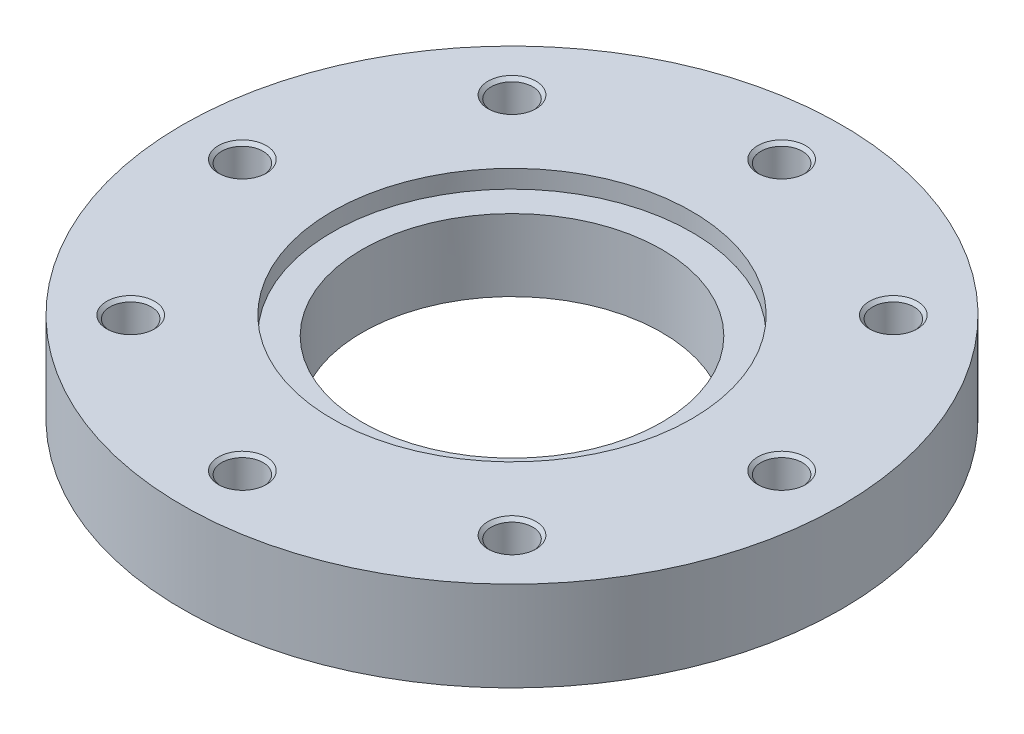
ISO-10303-21;
HEADER;
FILE_DESCRIPTION(('STEP AP214'),'2;1');
FILE_NAME('part.step','',(''),(''),'','','');
FILE_SCHEMA(('AUTOMOTIVE_DESIGN { 1 0 10303 214 1 1 1 1 }'));
ENDSEC;
DATA;
#1=APPLICATION_CONTEXT('core data for automotive mechanical design processes');
#2=APPLICATION_PROTOCOL_DEFINITION('international standard','automotive_design',2000,#1);
#3=PRODUCT_CONTEXT('',#1,'mechanical');
#4=PRODUCT('Part','Part','',(#3));
#5=PRODUCT_RELATED_PRODUCT_CATEGORY('part','',(#4));
#6=PRODUCT_DEFINITION_FORMATION('','',#4);
#7=PRODUCT_DEFINITION_CONTEXT('part definition',#1,'design');
#8=PRODUCT_DEFINITION('design','',#6,#7);
#9=PRODUCT_DEFINITION_SHAPE('','',#8);
#10=(LENGTH_UNIT() NAMED_UNIT(*) SI_UNIT(.MILLI.,.METRE.));
#11=(NAMED_UNIT(*) PLANE_ANGLE_UNIT() SI_UNIT($,.RADIAN.));
#12=(NAMED_UNIT(*) SI_UNIT($,.STERADIAN.) SOLID_ANGLE_UNIT());
#13=UNCERTAINTY_MEASURE_WITH_UNIT(LENGTH_MEASURE(1.E-05),#10,'distance_accuracy_value','');
#14=(GEOMETRIC_REPRESENTATION_CONTEXT(3) GLOBAL_UNCERTAINTY_ASSIGNED_CONTEXT((#13)) GLOBAL_UNIT_ASSIGNED_CONTEXT((#10,
#11,#12)) REPRESENTATION_CONTEXT('',''));
#15=CARTESIAN_POINT('',(0.,0.,0.));
#16=DIRECTION('',(0.,0.,1.));
#17=DIRECTION('',(1.,0.,0.));
#18=AXIS2_PLACEMENT_3D('',#15,#16,#17);
#19=CARTESIAN_POINT('',(0.,15.,0.));
#20=DIRECTION('',(0.,-1.,0.));
#21=DIRECTION('',(1.,0.,0.));
#22=AXIS2_PLACEMENT_3D('',#19,#20,#21);
#23=CYLINDRICAL_SURFACE('',#22,110.);
#24=CARTESIAN_POINT('',(0.,0.,0.));
#25=DIRECTION('',(0.,1.,0.));
#26=DIRECTION('',(1.,0.,0.));
#27=AXIS2_PLACEMENT_3D('',#24,#25,#26);
#28=CIRCLE('',#27,110.);
#29=CARTESIAN_POINT('',(110.,0.,0.));
#30=VERTEX_POINT('',#29);
#31=EDGE_CURVE('E9',#30,#30,#28,.T.);
#32=ORIENTED_EDGE('',*,*,#31,.T.);
#33=EDGE_LOOP('',(#32));
#34=FACE_BOUND('',#33,.T.);
#35=CARTESIAN_POINT('',(0.,30.,0.));
#36=DIRECTION('',(0.,1.,0.));
#37=DIRECTION('',(1.,0.,0.));
#38=AXIS2_PLACEMENT_3D('',#35,#36,#37);
#39=CIRCLE('',#38,110.);
#40=CARTESIAN_POINT('',(110.,30.,0.));
#41=VERTEX_POINT('',#40);
#42=EDGE_CURVE('E174',#41,#41,#39,.T.);
#43=ORIENTED_EDGE('',*,*,#42,.F.);
#44=EDGE_LOOP('',(#43));
#45=FACE_BOUND('',#44,.T.);
#46=ADVANCED_FACE('F15',(#34,#45),#23,.T.);
#47=CARTESIAN_POINT('',(80.,0.,0.));
#48=DIRECTION('',(0.,-1.,0.));
#49=DIRECTION('',(-1.,0.,0.));
#50=AXIS2_PLACEMENT_3D('',#47,#48,#49);
#51=PLANE('',#50);
#52=CARTESIAN_POINT('',(0.,0.,0.));
#53=DIRECTION('',(0.,1.,0.));
#54=DIRECTION('',(1.,0.,0.));
#55=AXIS2_PLACEMENT_3D('',#52,#53,#54);
#56=CIRCLE('',#55,50.);
#57=CARTESIAN_POINT('',(50.,0.,0.));
#58=VERTEX_POINT('',#57);
#59=EDGE_CURVE('E23',#58,#58,#56,.T.);
#60=ORIENTED_EDGE('',*,*,#59,.T.);
#61=EDGE_LOOP('',(#60));
#62=FACE_BOUND('',#61,.T.);
#63=ORIENTED_EDGE('',*,*,#31,.F.);
#64=EDGE_LOOP('',(#63));
#65=FACE_BOUND('',#64,.T.);
#66=ADVANCED_FACE('F312',(#62,#65),#51,.T.);
#67=CARTESIAN_POINT('',(0.,15.,0.));
#68=DIRECTION('',(0.,-1.,0.));
#69=DIRECTION('',(1.,0.,0.));
#70=AXIS2_PLACEMENT_3D('',#67,#68,#69);
#71=CYLINDRICAL_SURFACE('',#70,50.);
#72=ORIENTED_EDGE('',*,*,#59,.F.);
#73=EDGE_LOOP('',(#72));
#74=FACE_BOUND('',#73,.T.);
#75=CARTESIAN_POINT('',(0.,24.,0.));
#76=DIRECTION('',(0.,1.,0.));
#77=DIRECTION('',(1.,0.,0.));
#78=AXIS2_PLACEMENT_3D('',#75,#76,#77);
#79=CIRCLE('',#78,50.);
#80=CARTESIAN_POINT('',(-50.,24.,0.));
#81=VERTEX_POINT('',#80);
#82=EDGE_CURVE('E171',#81,#81,#79,.T.);
#83=ORIENTED_EDGE('',*,*,#82,.T.);
#84=EDGE_LOOP('',(#83));
#85=FACE_BOUND('',#84,.T.);
#86=ADVANCED_FACE('F172',(#74,#85),#71,.F.);
#87=CARTESIAN_POINT('',(80.,30.,0.));
#88=DIRECTION('',(0.,1.,0.));
#89=DIRECTION('',(1.,0.,0.));
#90=AXIS2_PLACEMENT_3D('',#87,#88,#89);
#91=PLANE('',#90);
#92=ORIENTED_EDGE('',*,*,#42,.T.);
#93=EDGE_LOOP('',(#92));
#94=FACE_BOUND('',#93,.T.);
#95=CARTESIAN_POINT('',(0.,30.,0.));
#96=DIRECTION('',(0.,-1.,0.));
#97=DIRECTION('',(1.,0.,0.));
#98=AXIS2_PLACEMENT_3D('',#95,#96,#97);
#99=CIRCLE('',#98,60.);
#100=CARTESIAN_POINT('',(-60.,30.,0.));
#101=VERTEX_POINT('',#100);
#102=EDGE_CURVE('E177',#101,#101,#99,.T.);
#103=ORIENTED_EDGE('',*,*,#102,.T.);
#104=EDGE_LOOP('',(#103));
#105=FACE_BOUND('',#104,.T.);
#106=CARTESIAN_POINT('',(90.,30.,0.));
#107=DIRECTION('',(0.,-1.,0.));
#108=DIRECTION('',(1.,0.,0.));
#109=AXIS2_PLACEMENT_3D('',#106,#107,#108);
#110=CIRCLE('',#109,8.);
#111=CARTESIAN_POINT('',(98.,30.,0.));
#112=VERTEX_POINT('',#111);
#113=EDGE_CURVE('E188',#112,#112,#110,.T.);
#114=ORIENTED_EDGE('',*,*,#113,.T.);
#115=EDGE_LOOP('',(#114));
#116=FACE_BOUND('',#115,.T.);
#117=CARTESIAN_POINT('',(63.6396103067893,30.,-63.6396103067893));
#118=DIRECTION('',(0.,-1.,0.));
#119=DIRECTION('',(0.707106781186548,0.,-0.707106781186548));
#120=AXIS2_PLACEMENT_3D('',#117,#118,#119);
#121=CIRCLE('',#120,8.);
#122=CARTESIAN_POINT('',(69.2964645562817,30.,-69.2964645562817));
#123=VERTEX_POINT('',#122);
#124=EDGE_CURVE('E199',#123,#123,#121,.T.);
#125=ORIENTED_EDGE('',*,*,#124,.T.);
#126=EDGE_LOOP('',(#125));
#127=FACE_BOUND('',#126,.T.);
#128=CARTESIAN_POINT('',(0.,30.,-90.));
#129=DIRECTION('',(0.,-1.,0.));
#130=DIRECTION('',(0.,0.,-1.));
#131=AXIS2_PLACEMENT_3D('',#128,#129,#130);
#132=CIRCLE('',#131,8.);
#133=CARTESIAN_POINT('',(0.,30.,-98.));
#134=VERTEX_POINT('',#133);
#135=EDGE_CURVE('E209',#134,#134,#132,.T.);
#136=ORIENTED_EDGE('',*,*,#135,.T.);
#137=EDGE_LOOP('',(#136));
#138=FACE_BOUND('',#137,.T.);
#139=CARTESIAN_POINT('',(-63.6396103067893,30.,-63.6396103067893));
#140=DIRECTION('',(0.,-1.,0.));
#141=DIRECTION('',(-0.707106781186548,0.,-0.707106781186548));
#142=AXIS2_PLACEMENT_3D('',#139,#140,#141);
#143=CIRCLE('',#142,8.);
#144=CARTESIAN_POINT('',(-69.2964645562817,30.,-69.2964645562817));
#145=VERTEX_POINT('',#144);
#146=EDGE_CURVE('E223',#145,#145,#143,.T.);
#147=ORIENTED_EDGE('',*,*,#146,.T.);
#148=EDGE_LOOP('',(#147));
#149=FACE_BOUND('',#148,.T.);
#150=CARTESIAN_POINT('',(-90.,30.,0.));
#151=DIRECTION('',(0.,-1.,0.));
#152=DIRECTION('',(-1.,0.,0.));
#153=AXIS2_PLACEMENT_3D('',#150,#151,#152);
#154=CIRCLE('',#153,8.);
#155=CARTESIAN_POINT('',(-98.,30.,0.));
#156=VERTEX_POINT('',#155);
#157=EDGE_CURVE('E235',#156,#156,#154,.T.);
#158=ORIENTED_EDGE('',*,*,#157,.T.);
#159=EDGE_LOOP('',(#158));
#160=FACE_BOUND('',#159,.T.);
#161=CARTESIAN_POINT('',(-63.6396103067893,30.,63.6396103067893));
#162=DIRECTION('',(0.,-1.,0.));
#163=DIRECTION('',(-0.707106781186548,0.,0.707106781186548));
#164=AXIS2_PLACEMENT_3D('',#161,#162,#163);
#165=CIRCLE('',#164,8.);
#166=CARTESIAN_POINT('',(-69.2964645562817,30.,69.2964645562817));
#167=VERTEX_POINT('',#166);
#168=EDGE_CURVE('E248',#167,#167,#165,.T.);
#169=ORIENTED_EDGE('',*,*,#168,.T.);
#170=EDGE_LOOP('',(#169));
#171=FACE_BOUND('',#170,.T.);
#172=CARTESIAN_POINT('',(0.,30.,90.));
#173=DIRECTION('',(0.,-1.,0.));
#174=DIRECTION('',(0.,0.,1.));
#175=AXIS2_PLACEMENT_3D('',#172,#173,#174);
#176=CIRCLE('',#175,8.);
#177=CARTESIAN_POINT('',(0.,30.,98.));
#178=VERTEX_POINT('',#177);
#179=EDGE_CURVE('E259',#178,#178,#176,.T.);
#180=ORIENTED_EDGE('',*,*,#179,.T.);
#181=EDGE_LOOP('',(#180));
#182=FACE_BOUND('',#181,.T.);
#183=CARTESIAN_POINT('',(63.6396103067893,30.,63.6396103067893));
#184=DIRECTION('',(0.,-1.,0.));
#185=DIRECTION('',(0.707106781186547,0.,0.707106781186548));
#186=AXIS2_PLACEMENT_3D('',#183,#184,#185);
#187=CIRCLE('',#186,8.);
#188=CARTESIAN_POINT('',(69.2964645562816,30.,69.2964645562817));
#189=VERTEX_POINT('',#188);
#190=EDGE_CURVE('E279',#189,#189,#187,.T.);
#191=ORIENTED_EDGE('',*,*,#190,.T.);
#192=EDGE_LOOP('',(#191));
#193=FACE_BOUND('',#192,.T.);
#194=ADVANCED_FACE('F382',(#94,#105,#116,#127,#138,#149,#160,#171,#182,#193),#91,.T.);
#195=CARTESIAN_POINT('',(0.,24.,0.));
#196=DIRECTION('',(0.,-1.,0.));
#197=DIRECTION('',(-1.,0.,0.));
#198=AXIS2_PLACEMENT_3D('',#195,#196,#197);
#199=PLANE('',#198);
#200=CARTESIAN_POINT('',(0.,24.,0.));
#201=DIRECTION('',(0.,-1.,0.));
#202=DIRECTION('',(1.,0.,0.));
#203=AXIS2_PLACEMENT_3D('',#200,#201,#202);
#204=CIRCLE('',#203,60.);
#205=CARTESIAN_POINT('',(60.,24.,0.));
#206=VERTEX_POINT('',#205);
#207=EDGE_CURVE('E175',#206,#206,#204,.T.);
#208=ORIENTED_EDGE('',*,*,#207,.F.);
#209=EDGE_LOOP('',(#208));
#210=FACE_BOUND('',#209,.T.);
#211=ORIENTED_EDGE('',*,*,#82,.F.);
#212=EDGE_LOOP('',(#211));
#213=FACE_BOUND('',#212,.T.);
#214=ADVANCED_FACE('F309',(#210,#213),#199,.F.);
#215=CARTESIAN_POINT('',(0.,28.5,0.));
#216=DIRECTION('',(0.,-1.,0.));
#217=DIRECTION('',(1.,0.,0.));
#218=AXIS2_PLACEMENT_3D('',#215,#216,#217);
#219=CYLINDRICAL_SURFACE('',#218,60.);
#220=ORIENTED_EDGE('',*,*,#207,.T.);
#221=EDGE_LOOP('',(#220));
#222=FACE_BOUND('',#221,.T.);
#223=ORIENTED_EDGE('',*,*,#102,.F.);
#224=EDGE_LOOP('',(#223));
#225=FACE_BOUND('',#224,.T.);
#226=ADVANCED_FACE('F17',(#222,#225),#219,.F.);
#227=CARTESIAN_POINT('',(90.,5.00308975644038,0.));
#228=DIRECTION('',(0.,1.,0.));
#229=DIRECTION('',(1.,0.,0.));
#230=AXIS2_PLACEMENT_3D('',#227,#228,#229);
#231=CONICAL_SURFACE('',#230,3.45875,1.0471975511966);
#232=CARTESIAN_POINT('',(90.,7.,0.));
#233=DIRECTION('',(0.,-1.,0.));
#234=DIRECTION('',(1.,0.,0.));
#235=AXIS2_PLACEMENT_3D('',#232,#233,#234);
#236=CIRCLE('',#235,6.9175);
#237=CARTESIAN_POINT('',(96.9175,7.,0.));
#238=VERTEX_POINT('',#237);
#239=EDGE_CURVE('E181',#238,#238,#236,.T.);
#240=ORIENTED_EDGE('',*,*,#239,.F.);
#241=EDGE_LOOP('',(#240));
#242=FACE_BOUND('',#241,.T.);
#243=CARTESIAN_POINT('',(90.,3.00617951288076,0.));
#244=VERTEX_POINT('',#243);
#245=VERTEX_LOOP('',#244);
#246=FACE_BOUND('',#245,.T.);
#247=ADVANCED_FACE('F299',(#242,#246),#231,.F.);
#248=CARTESIAN_POINT('',(90.,9.95875,0.));
#249=DIRECTION('',(0.,1.,0.));
#250=DIRECTION('',(1.,0.,0.));
#251=AXIS2_PLACEMENT_3D('',#248,#249,#250);
#252=CYLINDRICAL_SURFACE('',#251,6.9175);
#253=CARTESIAN_POINT('',(90.,12.9175,0.));
#254=DIRECTION('',(0.,-1.,0.));
#255=DIRECTION('',(1.,0.,0.));
#256=AXIS2_PLACEMENT_3D('',#253,#254,#255);
#257=CIRCLE('',#256,6.9175);
#258=CARTESIAN_POINT('',(96.9175,12.9175,0.));
#259=VERTEX_POINT('',#258);
#260=EDGE_CURVE('E183',#259,#259,#257,.T.);
#261=ORIENTED_EDGE('',*,*,#260,.F.);
#262=EDGE_LOOP('',(#261));
#263=FACE_BOUND('',#262,.T.);
#264=ORIENTED_EDGE('',*,*,#239,.T.);
#265=EDGE_LOOP('',(#264));
#266=FACE_BOUND('',#265,.T.);
#267=ADVANCED_FACE('F296',(#263,#266),#252,.F.);
#268=CARTESIAN_POINT('',(90.,13.45875,0.));
#269=DIRECTION('',(0.,1.,0.));
#270=DIRECTION('',(1.,0.,0.));
#271=AXIS2_PLACEMENT_3D('',#268,#269,#270);
#272=CONICAL_SURFACE('',#271,7.45875,0.785398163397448);
#273=CARTESIAN_POINT('',(90.,14.,0.));
#274=DIRECTION('',(0.,-1.,0.));
#275=DIRECTION('',(1.,0.,0.));
#276=AXIS2_PLACEMENT_3D('',#273,#274,#275);
#277=CIRCLE('',#276,8.);
#278=CARTESIAN_POINT('',(98.,14.,0.));
#279=VERTEX_POINT('',#278);
#280=EDGE_CURVE('E187',#279,#279,#277,.T.);
#281=ORIENTED_EDGE('',*,*,#280,.F.);
#282=EDGE_LOOP('',(#281));
#283=FACE_BOUND('',#282,.T.);
#284=ORIENTED_EDGE('',*,*,#260,.T.);
#285=EDGE_LOOP('',(#284));
#286=FACE_BOUND('',#285,.T.);
#287=ADVANCED_FACE('F294',(#283,#286),#272,.F.);
#288=CARTESIAN_POINT('',(97.45875,14.,0.));
#289=DIRECTION('',(0.,1.,0.));
#290=DIRECTION('',(-1.,0.,0.));
#291=AXIS2_PLACEMENT_3D('',#288,#289,#290);
#292=PLANE('',#291);
#293=CARTESIAN_POINT('',(90.,14.,0.));
#294=DIRECTION('',(0.,-1.,0.));
#295=DIRECTION('',(1.,0.,0.));
#296=AXIS2_PLACEMENT_3D('',#293,#294,#295);
#297=CIRCLE('',#296,6.9175);
#298=CARTESIAN_POINT('',(96.9175,14.,0.));
#299=VERTEX_POINT('',#298);
#300=EDGE_CURVE('E184',#299,#299,#297,.T.);
#301=ORIENTED_EDGE('',*,*,#300,.F.);
#302=EDGE_LOOP('',(#301));
#303=FACE_BOUND('',#302,.T.);
#304=ORIENTED_EDGE('',*,*,#280,.T.);
#305=EDGE_LOOP('',(#304));
#306=FACE_BOUND('',#305,.T.);
#307=ADVANCED_FACE('F426',(#303,#306),#292,.F.);
#308=CARTESIAN_POINT('',(90.,21.45875,0.));
#309=DIRECTION('',(0.,1.,0.));
#310=DIRECTION('',(1.,0.,0.));
#311=AXIS2_PLACEMENT_3D('',#308,#309,#310);
#312=CYLINDRICAL_SURFACE('',#311,6.9175);
#313=CARTESIAN_POINT('',(90.,28.9175,0.));
#314=DIRECTION('',(0.,-1.,0.));
#315=DIRECTION('',(1.,0.,0.));
#316=AXIS2_PLACEMENT_3D('',#313,#314,#315);
#317=CIRCLE('',#316,6.9175);
#318=CARTESIAN_POINT('',(96.9175,28.9175,0.));
#319=VERTEX_POINT('',#318);
#320=EDGE_CURVE('E190',#319,#319,#317,.T.);
#321=ORIENTED_EDGE('',*,*,#320,.F.);
#322=EDGE_LOOP('',(#321));
#323=FACE_BOUND('',#322,.T.);
#324=ORIENTED_EDGE('',*,*,#300,.T.);
#325=EDGE_LOOP('',(#324));
#326=FACE_BOUND('',#325,.T.);
#327=ADVANCED_FACE('F422',(#323,#326),#312,.F.);
#328=CARTESIAN_POINT('',(90.,29.45875,0.));
#329=DIRECTION('',(0.,1.,0.));
#330=DIRECTION('',(1.,0.,0.));
#331=AXIS2_PLACEMENT_3D('',#328,#329,#330);
#332=CONICAL_SURFACE('',#331,7.45875,0.785398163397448);
#333=ORIENTED_EDGE('',*,*,#113,.F.);
#334=EDGE_LOOP('',(#333));
#335=FACE_BOUND('',#334,.T.);
#336=ORIENTED_EDGE('',*,*,#320,.T.);
#337=EDGE_LOOP('',(#336));
#338=FACE_BOUND('',#337,.T.);
#339=ADVANCED_FACE('F418',(#335,#338),#332,.F.);
#340=CARTESIAN_POINT('',(63.6396103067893,5.00308975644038,-63.6396103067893));
#341=DIRECTION('',(0.,1.,0.));
#342=DIRECTION('',(0.707106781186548,0.,-0.707106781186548));
#343=AXIS2_PLACEMENT_3D('',#340,#341,#342);
#344=CONICAL_SURFACE('',#343,3.45875,1.0471975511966);
#345=CARTESIAN_POINT('',(63.6396103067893,7.,-63.6396103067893));
#346=DIRECTION('',(0.,-1.,0.));
#347=DIRECTION('',(0.707106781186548,0.,-0.707106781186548));
#348=AXIS2_PLACEMENT_3D('',#345,#346,#347);
#349=CIRCLE('',#348,6.9175);
#350=CARTESIAN_POINT('',(68.5310214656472,7.,-68.5310214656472));
#351=VERTEX_POINT('',#350);
#352=EDGE_CURVE('E191',#351,#351,#349,.T.);
#353=ORIENTED_EDGE('',*,*,#352,.F.);
#354=EDGE_LOOP('',(#353));
#355=FACE_BOUND('',#354,.T.);
#356=CARTESIAN_POINT('',(63.6396103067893,3.00617951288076,-63.6396103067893));
#357=VERTEX_POINT('',#356);
#358=VERTEX_LOOP('',#357);
#359=FACE_BOUND('',#358,.T.);
#360=ADVANCED_FACE('F414',(#355,#359),#344,.F.);
#361=CARTESIAN_POINT('',(63.6396103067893,9.95875,-63.6396103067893));
#362=DIRECTION('',(0.,1.,0.));
#363=DIRECTION('',(0.707106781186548,0.,-0.707106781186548));
#364=AXIS2_PLACEMENT_3D('',#361,#362,#363);
#365=CYLINDRICAL_SURFACE('',#364,6.9175);
#366=CARTESIAN_POINT('',(63.6396103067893,12.9175,-63.6396103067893));
#367=DIRECTION('',(0.,-1.,0.));
#368=DIRECTION('',(0.707106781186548,0.,-0.707106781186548));
#369=AXIS2_PLACEMENT_3D('',#366,#367,#368);
#370=CIRCLE('',#369,6.9175);
#371=CARTESIAN_POINT('',(68.5310214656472,12.9175,-68.5310214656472));
#372=VERTEX_POINT('',#371);
#373=EDGE_CURVE('E193',#372,#372,#370,.T.);
#374=ORIENTED_EDGE('',*,*,#373,.F.);
#375=EDGE_LOOP('',(#374));
#376=FACE_BOUND('',#375,.T.);
#377=ORIENTED_EDGE('',*,*,#352,.T.);
#378=EDGE_LOOP('',(#377));
#379=FACE_BOUND('',#378,.T.);
#380=ADVANCED_FACE('F410',(#376,#379),#365,.F.);
#381=CARTESIAN_POINT('',(63.6396103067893,13.45875,-63.6396103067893));
#382=DIRECTION('',(0.,1.,0.));
#383=DIRECTION('',(0.707106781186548,0.,-0.707106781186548));
#384=AXIS2_PLACEMENT_3D('',#381,#382,#383);
#385=CONICAL_SURFACE('',#384,7.45875,0.785398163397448);
#386=CARTESIAN_POINT('',(63.6396103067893,14.,-63.6396103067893));
#387=DIRECTION('',(0.,-1.,0.));
#388=DIRECTION('',(0.707106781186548,0.,-0.707106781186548));
#389=AXIS2_PLACEMENT_3D('',#386,#387,#388);
#390=CIRCLE('',#389,8.);
#391=CARTESIAN_POINT('',(69.2964645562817,14.,-69.2964645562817));
#392=VERTEX_POINT('',#391);
#393=EDGE_CURVE('E195',#392,#392,#390,.T.);
#394=ORIENTED_EDGE('',*,*,#393,.F.);
#395=EDGE_LOOP('',(#394));
#396=FACE_BOUND('',#395,.T.);
#397=ORIENTED_EDGE('',*,*,#373,.T.);
#398=EDGE_LOOP('',(#397));
#399=FACE_BOUND('',#398,.T.);
#400=ADVANCED_FACE('F406',(#396,#399),#385,.F.);
#401=CARTESIAN_POINT('',(68.9137430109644,14.,-68.9137430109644));
#402=DIRECTION('',(0.,1.,0.));
#403=DIRECTION('',(-0.707106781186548,0.,0.707106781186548));
#404=AXIS2_PLACEMENT_3D('',#401,#402,#403);
#405=PLANE('',#404);
#406=CARTESIAN_POINT('',(63.6396103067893,14.,-63.6396103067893));
#407=DIRECTION('',(0.,-1.,0.));
#408=DIRECTION('',(0.707106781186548,0.,-0.707106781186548));
#409=AXIS2_PLACEMENT_3D('',#406,#407,#408);
#410=CIRCLE('',#409,6.9175);
#411=CARTESIAN_POINT('',(68.5310214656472,14.,-68.5310214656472));
#412=VERTEX_POINT('',#411);
#413=EDGE_CURVE('E197',#412,#412,#410,.T.);
#414=ORIENTED_EDGE('',*,*,#413,.F.);
#415=EDGE_LOOP('',(#414));
#416=FACE_BOUND('',#415,.T.);
#417=ORIENTED_EDGE('',*,*,#393,.T.);
#418=EDGE_LOOP('',(#417));
#419=FACE_BOUND('',#418,.T.);
#420=ADVANCED_FACE('F402',(#416,#419),#405,.F.);
#421=CARTESIAN_POINT('',(63.6396103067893,21.45875,-63.6396103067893));
#422=DIRECTION('',(0.,1.,0.));
#423=DIRECTION('',(0.707106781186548,0.,-0.707106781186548));
#424=AXIS2_PLACEMENT_3D('',#421,#422,#423);
#425=CYLINDRICAL_SURFACE('',#424,6.9175);
#426=CARTESIAN_POINT('',(63.6396103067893,28.9175,-63.6396103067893));
#427=DIRECTION('',(0.,-1.,0.));
#428=DIRECTION('',(0.707106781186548,0.,-0.707106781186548));
#429=AXIS2_PLACEMENT_3D('',#426,#427,#428);
#430=CIRCLE('',#429,6.9175);
#431=CARTESIAN_POINT('',(68.5310214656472,28.9175,-68.5310214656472));
#432=VERTEX_POINT('',#431);
#433=EDGE_CURVE('E200',#432,#432,#430,.T.);
#434=ORIENTED_EDGE('',*,*,#433,.F.);
#435=EDGE_LOOP('',(#434));
#436=FACE_BOUND('',#435,.T.);
#437=ORIENTED_EDGE('',*,*,#413,.T.);
#438=EDGE_LOOP('',(#437));
#439=FACE_BOUND('',#438,.T.);
#440=ADVANCED_FACE('F398',(#436,#439),#425,.F.);
#441=CARTESIAN_POINT('',(63.6396103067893,29.45875,-63.6396103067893));
#442=DIRECTION('',(0.,1.,0.));
#443=DIRECTION('',(0.707106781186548,0.,-0.707106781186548));
#444=AXIS2_PLACEMENT_3D('',#441,#442,#443);
#445=CONICAL_SURFACE('',#444,7.45875,0.785398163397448);
#446=ORIENTED_EDGE('',*,*,#124,.F.);
#447=EDGE_LOOP('',(#446));
#448=FACE_BOUND('',#447,.T.);
#449=ORIENTED_EDGE('',*,*,#433,.T.);
#450=EDGE_LOOP('',(#449));
#451=FACE_BOUND('',#450,.T.);
#452=ADVANCED_FACE('F394',(#448,#451),#445,.F.);
#453=CARTESIAN_POINT('',(0.,5.00308975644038,-90.));
#454=DIRECTION('',(0.,1.,0.));
#455=DIRECTION('',(0.,0.,-1.));
#456=AXIS2_PLACEMENT_3D('',#453,#454,#455);
#457=CONICAL_SURFACE('',#456,3.45875,1.0471975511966);
#458=CARTESIAN_POINT('',(0.,7.,-90.));
#459=DIRECTION('',(0.,-1.,0.));
#460=DIRECTION('',(0.,0.,-1.));
#461=AXIS2_PLACEMENT_3D('',#458,#459,#460);
#462=CIRCLE('',#461,6.9175);
#463=CARTESIAN_POINT('',(0.,7.,-96.9175));
#464=VERTEX_POINT('',#463);
#465=EDGE_CURVE('E202',#464,#464,#462,.T.);
#466=ORIENTED_EDGE('',*,*,#465,.F.);
#467=EDGE_LOOP('',(#466));
#468=FACE_BOUND('',#467,.T.);
#469=CARTESIAN_POINT('',(0.,3.00617951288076,-90.));
#470=VERTEX_POINT('',#469);
#471=VERTEX_LOOP('',#470);
#472=FACE_BOUND('',#471,.T.);
#473=ADVANCED_FACE('F390',(#468,#472),#457,.F.);
#474=CARTESIAN_POINT('',(0.,9.95875,-90.));
#475=DIRECTION('',(0.,1.,0.));
#476=DIRECTION('',(0.,0.,-1.));
#477=AXIS2_PLACEMENT_3D('',#474,#475,#476);
#478=CYLINDRICAL_SURFACE('',#477,6.9175);
#479=CARTESIAN_POINT('',(0.,12.9175,-90.));
#480=DIRECTION('',(0.,-1.,0.));
#481=DIRECTION('',(0.,0.,-1.));
#482=AXIS2_PLACEMENT_3D('',#479,#480,#481);
#483=CIRCLE('',#482,6.9175);
#484=CARTESIAN_POINT('',(0.,12.9175,-96.9175));
#485=VERTEX_POINT('',#484);
#486=EDGE_CURVE('E204',#485,#485,#483,.T.);
#487=ORIENTED_EDGE('',*,*,#486,.F.);
#488=EDGE_LOOP('',(#487));
#489=FACE_BOUND('',#488,.T.);
#490=ORIENTED_EDGE('',*,*,#465,.T.);
#491=EDGE_LOOP('',(#490));
#492=FACE_BOUND('',#491,.T.);
#493=ADVANCED_FACE('F386',(#489,#492),#478,.F.);
#494=CARTESIAN_POINT('',(0.,13.45875,-90.));
#495=DIRECTION('',(0.,1.,0.));
#496=DIRECTION('',(0.,0.,-1.));
#497=AXIS2_PLACEMENT_3D('',#494,#495,#496);
#498=CONICAL_SURFACE('',#497,7.45875,0.785398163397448);
#499=CARTESIAN_POINT('',(0.,14.,-90.));
#500=DIRECTION('',(0.,-1.,0.));
#501=DIRECTION('',(0.,0.,-1.));
#502=AXIS2_PLACEMENT_3D('',#499,#500,#501);
#503=CIRCLE('',#502,8.);
#504=CARTESIAN_POINT('',(0.,14.,-98.));
#505=VERTEX_POINT('',#504);
#506=EDGE_CURVE('E205',#505,#505,#503,.T.);
#507=ORIENTED_EDGE('',*,*,#506,.F.);
#508=EDGE_LOOP('',(#507));
#509=FACE_BOUND('',#508,.T.);
#510=ORIENTED_EDGE('',*,*,#486,.T.);
#511=EDGE_LOOP('',(#510));
#512=FACE_BOUND('',#511,.T.);
#513=ADVANCED_FACE('F378',(#509,#512),#498,.F.);
#514=CARTESIAN_POINT('',(0.,14.,-97.45875));
#515=DIRECTION('',(0.,1.,0.));
#516=DIRECTION('',(0.,0.,1.));
#517=AXIS2_PLACEMENT_3D('',#514,#515,#516);
#518=PLANE('',#517);
#519=CARTESIAN_POINT('',(0.,14.,-90.));
#520=DIRECTION('',(0.,-1.,0.));
#521=DIRECTION('',(0.,0.,-1.));
#522=AXIS2_PLACEMENT_3D('',#519,#520,#521);
#523=CIRCLE('',#522,6.9175);
#524=CARTESIAN_POINT('',(0.,14.,-96.9175));
#525=VERTEX_POINT('',#524);
#526=EDGE_CURVE('E208',#525,#525,#523,.T.);
#527=ORIENTED_EDGE('',*,*,#526,.F.);
#528=EDGE_LOOP('',(#527));
#529=FACE_BOUND('',#528,.T.);
#530=ORIENTED_EDGE('',*,*,#506,.T.);
#531=EDGE_LOOP('',(#530));
#532=FACE_BOUND('',#531,.T.);
#533=ADVANCED_FACE('F374',(#529,#532),#518,.F.);
#534=CARTESIAN_POINT('',(0.,21.45875,-90.));
#535=DIRECTION('',(0.,1.,0.));
#536=DIRECTION('',(0.,0.,-1.));
#537=AXIS2_PLACEMENT_3D('',#534,#535,#536);
#538=CYLINDRICAL_SURFACE('',#537,6.9175);
#539=CARTESIAN_POINT('',(0.,28.9175,-90.));
#540=DIRECTION('',(0.,-1.,0.));
#541=DIRECTION('',(0.,0.,-1.));
#542=AXIS2_PLACEMENT_3D('',#539,#540,#541);
#543=CIRCLE('',#542,6.9175);
#544=CARTESIAN_POINT('',(0.,28.9175,-96.9175));
#545=VERTEX_POINT('',#544);
#546=EDGE_CURVE('E212',#545,#545,#543,.T.);
#547=ORIENTED_EDGE('',*,*,#546,.F.);
#548=EDGE_LOOP('',(#547));
#549=FACE_BOUND('',#548,.T.);
#550=ORIENTED_EDGE('',*,*,#526,.T.);
#551=EDGE_LOOP('',(#550));
#552=FACE_BOUND('',#551,.T.);
#553=ADVANCED_FACE('F370',(#549,#552),#538,.F.);
#554=CARTESIAN_POINT('',(0.,29.45875,-90.));
#555=DIRECTION('',(0.,1.,0.));
#556=DIRECTION('',(0.,0.,-1.));
#557=AXIS2_PLACEMENT_3D('',#554,#555,#556);
#558=CONICAL_SURFACE('',#557,7.45875,0.785398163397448);
#559=ORIENTED_EDGE('',*,*,#135,.F.);
#560=EDGE_LOOP('',(#559));
#561=FACE_BOUND('',#560,.T.);
#562=ORIENTED_EDGE('',*,*,#546,.T.);
#563=EDGE_LOOP('',(#562));
#564=FACE_BOUND('',#563,.T.);
#565=ADVANCED_FACE('F366',(#561,#564),#558,.F.);
#566=CARTESIAN_POINT('',(-63.6396103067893,5.00308975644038,-63.6396103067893));
#567=DIRECTION('',(0.,1.,0.));
#568=DIRECTION('',(-0.707106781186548,0.,-0.707106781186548));
#569=AXIS2_PLACEMENT_3D('',#566,#567,#568);
#570=CONICAL_SURFACE('',#569,3.45875,1.0471975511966);
#571=CARTESIAN_POINT('',(-63.6396103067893,7.,-63.6396103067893));
#572=DIRECTION('',(0.,-1.,0.));
#573=DIRECTION('',(-0.707106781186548,0.,-0.707106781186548));
#574=AXIS2_PLACEMENT_3D('',#571,#572,#573);
#575=CIRCLE('',#574,6.9175);
#576=CARTESIAN_POINT('',(-68.5310214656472,7.,-68.5310214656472));
#577=VERTEX_POINT('',#576);
#578=EDGE_CURVE('E214',#577,#577,#575,.T.);
#579=ORIENTED_EDGE('',*,*,#578,.F.);
#580=EDGE_LOOP('',(#579));
#581=FACE_BOUND('',#580,.T.);
#582=CARTESIAN_POINT('',(-63.6396103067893,3.00617951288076,-63.6396103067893));
#583=VERTEX_POINT('',#582);
#584=VERTEX_LOOP('',#583);
#585=FACE_BOUND('',#584,.T.);
#586=ADVANCED_FACE('F361',(#581,#585),#570,.F.);
#587=CARTESIAN_POINT('',(-63.6396103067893,9.95875,-63.6396103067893));
#588=DIRECTION('',(0.,1.,0.));
#589=DIRECTION('',(-0.707106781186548,0.,-0.707106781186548));
#590=AXIS2_PLACEMENT_3D('',#587,#588,#589);
#591=CYLINDRICAL_SURFACE('',#590,6.9175);
#592=CARTESIAN_POINT('',(-63.6396103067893,12.9175,-63.6396103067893));
#593=DIRECTION('',(0.,-1.,0.));
#594=DIRECTION('',(-0.707106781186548,0.,-0.707106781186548));
#595=AXIS2_PLACEMENT_3D('',#592,#593,#594);
#596=CIRCLE('',#595,6.9175);
#597=CARTESIAN_POINT('',(-68.5310214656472,12.9175,-68.5310214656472));
#598=VERTEX_POINT('',#597);
#599=EDGE_CURVE('E216',#598,#598,#596,.T.);
#600=ORIENTED_EDGE('',*,*,#599,.F.);
#601=EDGE_LOOP('',(#600));
#602=FACE_BOUND('',#601,.T.);
#603=ORIENTED_EDGE('',*,*,#578,.T.);
#604=EDGE_LOOP('',(#603));
#605=FACE_BOUND('',#604,.T.);
#606=ADVANCED_FACE('F358',(#602,#605),#591,.F.);
#607=CARTESIAN_POINT('',(-63.6396103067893,13.45875,-63.6396103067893));
#608=DIRECTION('',(0.,1.,0.));
#609=DIRECTION('',(-0.707106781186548,0.,-0.707106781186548));
#610=AXIS2_PLACEMENT_3D('',#607,#608,#609);
#611=CONICAL_SURFACE('',#610,7.45875,0.785398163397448);
#612=CARTESIAN_POINT('',(-63.6396103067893,14.,-63.6396103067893));
#613=DIRECTION('',(0.,-1.,0.));
#614=DIRECTION('',(-0.707106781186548,0.,-0.707106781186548));
#615=AXIS2_PLACEMENT_3D('',#612,#613,#614);
#616=CIRCLE('',#615,8.);
#617=CARTESIAN_POINT('',(-69.2964645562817,14.,-69.2964645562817));
#618=VERTEX_POINT('',#617);
#619=EDGE_CURVE('E218',#618,#618,#616,.T.);
#620=ORIENTED_EDGE('',*,*,#619,.F.);
#621=EDGE_LOOP('',(#620));
#622=FACE_BOUND('',#621,.T.);
#623=ORIENTED_EDGE('',*,*,#599,.T.);
#624=EDGE_LOOP('',(#623));
#625=FACE_BOUND('',#624,.T.);
#626=ADVANCED_FACE('F354',(#622,#625),#611,.F.);
#627=CARTESIAN_POINT('',(-68.9137430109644,14.,-68.9137430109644));
#628=DIRECTION('',(0.,1.,0.));
#629=DIRECTION('',(0.707106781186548,0.,0.707106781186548));
#630=AXIS2_PLACEMENT_3D('',#627,#628,#629);
#631=PLANE('',#630);
#632=CARTESIAN_POINT('',(-63.6396103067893,14.,-63.6396103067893));
#633=DIRECTION('',(0.,-1.,0.));
#634=DIRECTION('',(-0.707106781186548,0.,-0.707106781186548));
#635=AXIS2_PLACEMENT_3D('',#632,#633,#634);
#636=CIRCLE('',#635,6.9175);
#637=CARTESIAN_POINT('',(-68.5310214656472,14.,-68.5310214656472));
#638=VERTEX_POINT('',#637);
#639=EDGE_CURVE('E220',#638,#638,#636,.T.);
#640=ORIENTED_EDGE('',*,*,#639,.F.);
#641=EDGE_LOOP('',(#640));
#642=FACE_BOUND('',#641,.T.);
#643=ORIENTED_EDGE('',*,*,#619,.T.);
#644=EDGE_LOOP('',(#643));
#645=FACE_BOUND('',#644,.T.);
#646=ADVANCED_FACE('F350',(#642,#645),#631,.F.);
#647=CARTESIAN_POINT('',(-63.6396103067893,21.45875,-63.6396103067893));
#648=DIRECTION('',(0.,1.,0.));
#649=DIRECTION('',(-0.707106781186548,0.,-0.707106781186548));
#650=AXIS2_PLACEMENT_3D('',#647,#648,#649);
#651=CYLINDRICAL_SURFACE('',#650,6.9175);
#652=CARTESIAN_POINT('',(-63.6396103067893,28.9175,-63.6396103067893));
#653=DIRECTION('',(0.,-1.,0.));
#654=DIRECTION('',(-0.707106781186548,0.,-0.707106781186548));
#655=AXIS2_PLACEMENT_3D('',#652,#653,#654);
#656=CIRCLE('',#655,6.9175);
#657=CARTESIAN_POINT('',(-68.5310214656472,28.9175,-68.5310214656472));
#658=VERTEX_POINT('',#657);
#659=EDGE_CURVE('E225',#658,#658,#656,.T.);
#660=ORIENTED_EDGE('',*,*,#659,.F.);
#661=EDGE_LOOP('',(#660));
#662=FACE_BOUND('',#661,.T.);
#663=ORIENTED_EDGE('',*,*,#639,.T.);
#664=EDGE_LOOP('',(#663));
#665=FACE_BOUND('',#664,.T.);
#666=ADVANCED_FACE('F346',(#662,#665),#651,.F.);
#667=CARTESIAN_POINT('',(-63.6396103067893,29.45875,-63.6396103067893));
#668=DIRECTION('',(0.,1.,0.));
#669=DIRECTION('',(-0.707106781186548,0.,-0.707106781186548));
#670=AXIS2_PLACEMENT_3D('',#667,#668,#669);
#671=CONICAL_SURFACE('',#670,7.45875,0.785398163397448);
#672=ORIENTED_EDGE('',*,*,#146,.F.);
#673=EDGE_LOOP('',(#672));
#674=FACE_BOUND('',#673,.T.);
#675=ORIENTED_EDGE('',*,*,#659,.T.);
#676=EDGE_LOOP('',(#675));
#677=FACE_BOUND('',#676,.T.);
#678=ADVANCED_FACE('F342',(#674,#677),#671,.F.);
#679=CARTESIAN_POINT('',(-90.,5.00308975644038,0.));
#680=DIRECTION('',(0.,1.,0.));
#681=DIRECTION('',(-1.,0.,0.));
#682=AXIS2_PLACEMENT_3D('',#679,#680,#681);
#683=CONICAL_SURFACE('',#682,3.45875,1.0471975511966);
#684=CARTESIAN_POINT('',(-90.,7.,0.));
#685=DIRECTION('',(0.,-1.,0.));
#686=DIRECTION('',(-1.,0.,0.));
#687=AXIS2_PLACEMENT_3D('',#684,#685,#686);
#688=CIRCLE('',#687,6.9175);
#689=CARTESIAN_POINT('',(-96.9175,7.,0.));
#690=VERTEX_POINT('',#689);
#691=EDGE_CURVE('E227',#690,#690,#688,.T.);
#692=ORIENTED_EDGE('',*,*,#691,.F.);
#693=EDGE_LOOP('',(#692));
#694=FACE_BOUND('',#693,.T.);
#695=CARTESIAN_POINT('',(-90.,3.00617951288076,0.));
#696=VERTEX_POINT('',#695);
#697=VERTEX_LOOP('',#696);
#698=FACE_BOUND('',#697,.T.);
#699=ADVANCED_FACE('F338',(#694,#698),#683,.F.);
#700=CARTESIAN_POINT('',(-90.,9.95875,0.));
#701=DIRECTION('',(0.,1.,0.));
#702=DIRECTION('',(-1.,0.,0.));
#703=AXIS2_PLACEMENT_3D('',#700,#701,#702);
#704=CYLINDRICAL_SURFACE('',#703,6.9175);
#705=CARTESIAN_POINT('',(-90.,12.9175,0.));
#706=DIRECTION('',(0.,-1.,0.));
#707=DIRECTION('',(-1.,0.,0.));
#708=AXIS2_PLACEMENT_3D('',#705,#706,#707);
#709=CIRCLE('',#708,6.9175);
#710=CARTESIAN_POINT('',(-96.9175,12.9175,0.));
#711=VERTEX_POINT('',#710);
#712=EDGE_CURVE('E229',#711,#711,#709,.T.);
#713=ORIENTED_EDGE('',*,*,#712,.F.);
#714=EDGE_LOOP('',(#713));
#715=FACE_BOUND('',#714,.T.);
#716=ORIENTED_EDGE('',*,*,#691,.T.);
#717=EDGE_LOOP('',(#716));
#718=FACE_BOUND('',#717,.T.);
#719=ADVANCED_FACE('F334',(#715,#718),#704,.F.);
#720=CARTESIAN_POINT('',(-90.,13.45875,0.));
#721=DIRECTION('',(0.,1.,0.));
#722=DIRECTION('',(-1.,0.,0.));
#723=AXIS2_PLACEMENT_3D('',#720,#721,#722);
#724=CONICAL_SURFACE('',#723,7.45875,0.785398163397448);
#725=CARTESIAN_POINT('',(-90.,14.,0.));
#726=DIRECTION('',(0.,-1.,0.));
#727=DIRECTION('',(-1.,0.,0.));
#728=AXIS2_PLACEMENT_3D('',#725,#726,#727);
#729=CIRCLE('',#728,8.);
#730=CARTESIAN_POINT('',(-98.,14.,0.));
#731=VERTEX_POINT('',#730);
#732=EDGE_CURVE('E231',#731,#731,#729,.T.);
#733=ORIENTED_EDGE('',*,*,#732,.F.);
#734=EDGE_LOOP('',(#733));
#735=FACE_BOUND('',#734,.T.);
#736=ORIENTED_EDGE('',*,*,#712,.T.);
#737=EDGE_LOOP('',(#736));
#738=FACE_BOUND('',#737,.T.);
#739=ADVANCED_FACE('F330',(#735,#738),#724,.F.);
#740=CARTESIAN_POINT('',(-97.45875,14.,0.));
#741=DIRECTION('',(0.,1.,0.));
#742=DIRECTION('',(1.,0.,0.));
#743=AXIS2_PLACEMENT_3D('',#740,#741,#742);
#744=PLANE('',#743);
#745=CARTESIAN_POINT('',(-90.,14.,0.));
#746=DIRECTION('',(0.,-1.,0.));
#747=DIRECTION('',(-1.,0.,0.));
#748=AXIS2_PLACEMENT_3D('',#745,#746,#747);
#749=CIRCLE('',#748,6.9175);
#750=CARTESIAN_POINT('',(-96.9175,14.,0.));
#751=VERTEX_POINT('',#750);
#752=EDGE_CURVE('E233',#751,#751,#749,.T.);
#753=ORIENTED_EDGE('',*,*,#752,.F.);
#754=EDGE_LOOP('',(#753));
#755=FACE_BOUND('',#754,.T.);
#756=ORIENTED_EDGE('',*,*,#732,.T.);
#757=EDGE_LOOP('',(#756));
#758=FACE_BOUND('',#757,.T.);
#759=ADVANCED_FACE('F326',(#755,#758),#744,.F.);
#760=CARTESIAN_POINT('',(-90.,21.45875,0.));
#761=DIRECTION('',(0.,1.,0.));
#762=DIRECTION('',(-1.,0.,0.));
#763=AXIS2_PLACEMENT_3D('',#760,#761,#762);
#764=CYLINDRICAL_SURFACE('',#763,6.9175);
#765=CARTESIAN_POINT('',(-90.,28.9175,0.));
#766=DIRECTION('',(0.,-1.,0.));
#767=DIRECTION('',(-1.,0.,0.));
#768=AXIS2_PLACEMENT_3D('',#765,#766,#767);
#769=CIRCLE('',#768,6.9175);
#770=CARTESIAN_POINT('',(-96.9175,28.9175,0.));
#771=VERTEX_POINT('',#770);
#772=EDGE_CURVE('E237',#771,#771,#769,.T.);
#773=ORIENTED_EDGE('',*,*,#772,.F.);
#774=EDGE_LOOP('',(#773));
#775=FACE_BOUND('',#774,.T.);
#776=ORIENTED_EDGE('',*,*,#752,.T.);
#777=EDGE_LOOP('',(#776));
#778=FACE_BOUND('',#777,.T.);
#779=ADVANCED_FACE('F323',(#775,#778),#764,.F.);
#780=CARTESIAN_POINT('',(-90.,29.45875,0.));
#781=DIRECTION('',(0.,1.,0.));
#782=DIRECTION('',(-1.,0.,0.));
#783=AXIS2_PLACEMENT_3D('',#780,#781,#782);
#784=CONICAL_SURFACE('',#783,7.45875,0.785398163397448);
#785=ORIENTED_EDGE('',*,*,#157,.F.);
#786=EDGE_LOOP('',(#785));
#787=FACE_BOUND('',#786,.T.);
#788=ORIENTED_EDGE('',*,*,#772,.T.);
#789=EDGE_LOOP('',(#788));
#790=FACE_BOUND('',#789,.T.);
#791=ADVANCED_FACE('F321',(#787,#790),#784,.F.);
#792=CARTESIAN_POINT('',(-63.6396103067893,5.00308975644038,63.6396103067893));
#793=DIRECTION('',(0.,1.,0.));
#794=DIRECTION('',(-0.707106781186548,0.,0.707106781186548));
#795=AXIS2_PLACEMENT_3D('',#792,#793,#794);
#796=CONICAL_SURFACE('',#795,3.45875,1.0471975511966);
#797=CARTESIAN_POINT('',(-63.6396103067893,7.,63.6396103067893));
#798=DIRECTION('',(0.,-1.,0.));
#799=DIRECTION('',(-0.707106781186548,0.,0.707106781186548));
#800=AXIS2_PLACEMENT_3D('',#797,#798,#799);
#801=CIRCLE('',#800,6.9175);
#802=CARTESIAN_POINT('',(-68.5310214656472,7.,68.5310214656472));
#803=VERTEX_POINT('',#802);
#804=EDGE_CURVE('E240',#803,#803,#801,.T.);
#805=ORIENTED_EDGE('',*,*,#804,.F.);
#806=EDGE_LOOP('',(#805));
#807=FACE_BOUND('',#806,.T.);
#808=CARTESIAN_POINT('',(-63.6396103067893,3.00617951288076,63.6396103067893));
#809=VERTEX_POINT('',#808);
#810=VERTEX_LOOP('',#809);
#811=FACE_BOUND('',#810,.T.);
#812=ADVANCED_FACE('F551',(#807,#811),#796,.F.);
#813=CARTESIAN_POINT('',(-63.6396103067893,9.95875,63.6396103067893));
#814=DIRECTION('',(0.,1.,0.));
#815=DIRECTION('',(-0.707106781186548,0.,0.707106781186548));
#816=AXIS2_PLACEMENT_3D('',#813,#814,#815);
#817=CYLINDRICAL_SURFACE('',#816,6.9175);
#818=CARTESIAN_POINT('',(-63.6396103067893,12.9175,63.6396103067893));
#819=DIRECTION('',(0.,-1.,0.));
#820=DIRECTION('',(-0.707106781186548,0.,0.707106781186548));
#821=AXIS2_PLACEMENT_3D('',#818,#819,#820);
#822=CIRCLE('',#821,6.9175);
#823=CARTESIAN_POINT('',(-68.5310214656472,12.9175,68.5310214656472));
#824=VERTEX_POINT('',#823);
#825=EDGE_CURVE('E242',#824,#824,#822,.T.);
#826=ORIENTED_EDGE('',*,*,#825,.F.);
#827=EDGE_LOOP('',(#826));
#828=FACE_BOUND('',#827,.T.);
#829=ORIENTED_EDGE('',*,*,#804,.T.);
#830=EDGE_LOOP('',(#829));
#831=FACE_BOUND('',#830,.T.);
#832=ADVANCED_FACE('F558',(#828,#831),#817,.F.);
#833=CARTESIAN_POINT('',(-63.6396103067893,13.45875,63.6396103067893));
#834=DIRECTION('',(0.,1.,0.));
#835=DIRECTION('',(-0.707106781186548,0.,0.707106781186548));
#836=AXIS2_PLACEMENT_3D('',#833,#834,#835);
#837=CONICAL_SURFACE('',#836,7.45875,0.785398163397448);
#838=CARTESIAN_POINT('',(-63.6396103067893,14.,63.6396103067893));
#839=DIRECTION('',(0.,-1.,0.));
#840=DIRECTION('',(-0.707106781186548,0.,0.707106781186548));
#841=AXIS2_PLACEMENT_3D('',#838,#839,#840);
#842=CIRCLE('',#841,8.);
#843=CARTESIAN_POINT('',(-69.2964645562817,14.,69.2964645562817));
#844=VERTEX_POINT('',#843);
#845=EDGE_CURVE('E244',#844,#844,#842,.T.);
#846=ORIENTED_EDGE('',*,*,#845,.F.);
#847=EDGE_LOOP('',(#846));
#848=FACE_BOUND('',#847,.T.);
#849=ORIENTED_EDGE('',*,*,#825,.T.);
#850=EDGE_LOOP('',(#849));
#851=FACE_BOUND('',#850,.T.);
#852=ADVANCED_FACE('F565',(#848,#851),#837,.F.);
#853=CARTESIAN_POINT('',(-68.9137430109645,14.,68.9137430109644));
#854=DIRECTION('',(0.,1.,0.));
#855=DIRECTION('',(0.707106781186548,0.,-0.707106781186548));
#856=AXIS2_PLACEMENT_3D('',#853,#854,#855);
#857=PLANE('',#856);
#858=CARTESIAN_POINT('',(-63.6396103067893,14.,63.6396103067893));
#859=DIRECTION('',(0.,-1.,0.));
#860=DIRECTION('',(-0.707106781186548,0.,0.707106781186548));
#861=AXIS2_PLACEMENT_3D('',#858,#859,#860);
#862=CIRCLE('',#861,6.9175);
#863=CARTESIAN_POINT('',(-68.5310214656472,14.,68.5310214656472));
#864=VERTEX_POINT('',#863);
#865=EDGE_CURVE('E246',#864,#864,#862,.T.);
#866=ORIENTED_EDGE('',*,*,#865,.F.);
#867=EDGE_LOOP('',(#866));
#868=FACE_BOUND('',#867,.T.);
#869=ORIENTED_EDGE('',*,*,#845,.T.);
#870=EDGE_LOOP('',(#869));
#871=FACE_BOUND('',#870,.T.);
#872=ADVANCED_FACE('F573',(#868,#871),#857,.F.);
#873=CARTESIAN_POINT('',(-63.6396103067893,21.45875,63.6396103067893));
#874=DIRECTION('',(0.,1.,0.));
#875=DIRECTION('',(-0.707106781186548,0.,0.707106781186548));
#876=AXIS2_PLACEMENT_3D('',#873,#874,#875);
#877=CYLINDRICAL_SURFACE('',#876,6.9175);
#878=CARTESIAN_POINT('',(-63.6396103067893,28.9175,63.6396103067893));
#879=DIRECTION('',(0.,-1.,0.));
#880=DIRECTION('',(-0.707106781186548,0.,0.707106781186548));
#881=AXIS2_PLACEMENT_3D('',#878,#879,#880);
#882=CIRCLE('',#881,6.9175);
#883=CARTESIAN_POINT('',(-68.5310214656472,28.9175,68.5310214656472));
#884=VERTEX_POINT('',#883);
#885=EDGE_CURVE('E260',#884,#884,#882,.T.);
#886=ORIENTED_EDGE('',*,*,#885,.F.);
#887=EDGE_LOOP('',(#886));
#888=FACE_BOUND('',#887,.T.);
#889=ORIENTED_EDGE('',*,*,#865,.T.);
#890=EDGE_LOOP('',(#889));
#891=FACE_BOUND('',#890,.T.);
#892=ADVANCED_FACE('F581',(#888,#891),#877,.F.);
#893=CARTESIAN_POINT('',(-63.6396103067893,29.45875,63.6396103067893));
#894=DIRECTION('',(0.,1.,0.));
#895=DIRECTION('',(-0.707106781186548,0.,0.707106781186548));
#896=AXIS2_PLACEMENT_3D('',#893,#894,#895);
#897=CONICAL_SURFACE('',#896,7.45875,0.785398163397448);
#898=ORIENTED_EDGE('',*,*,#168,.F.);
#899=EDGE_LOOP('',(#898));
#900=FACE_BOUND('',#899,.T.);
#901=ORIENTED_EDGE('',*,*,#885,.T.);
#902=EDGE_LOOP('',(#901));
#903=FACE_BOUND('',#902,.T.);
#904=ADVANCED_FACE('F589',(#900,#903),#897,.F.);
#905=CARTESIAN_POINT('',(0.,5.00308975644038,90.));
#906=DIRECTION('',(0.,1.,0.));
#907=DIRECTION('',(0.,0.,1.));
#908=AXIS2_PLACEMENT_3D('',#905,#906,#907);
#909=CONICAL_SURFACE('',#908,3.45875,1.0471975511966);
#910=CARTESIAN_POINT('',(0.,7.,90.));
#911=DIRECTION('',(0.,-1.,0.));
#912=DIRECTION('',(0.,0.,1.));
#913=AXIS2_PLACEMENT_3D('',#910,#911,#912);
#914=CIRCLE('',#913,6.9175);
#915=CARTESIAN_POINT('',(0.,7.,96.9175));
#916=VERTEX_POINT('',#915);
#917=EDGE_CURVE('E252',#916,#916,#914,.T.);
#918=ORIENTED_EDGE('',*,*,#917,.F.);
#919=EDGE_LOOP('',(#918));
#920=FACE_BOUND('',#919,.T.);
#921=CARTESIAN_POINT('',(0.,3.00617951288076,90.));
#922=VERTEX_POINT('',#921);
#923=VERTEX_LOOP('',#922);
#924=FACE_BOUND('',#923,.T.);
#925=ADVANCED_FACE('F597',(#920,#924),#909,.F.);
#926=CARTESIAN_POINT('',(0.,9.95875,90.));
#927=DIRECTION('',(0.,1.,0.));
#928=DIRECTION('',(0.,0.,1.));
#929=AXIS2_PLACEMENT_3D('',#926,#927,#928);
#930=CYLINDRICAL_SURFACE('',#929,6.9175);
#931=CARTESIAN_POINT('',(0.,12.9175,90.));
#932=DIRECTION('',(0.,-1.,0.));
#933=DIRECTION('',(0.,0.,1.));
#934=AXIS2_PLACEMENT_3D('',#931,#932,#933);
#935=CIRCLE('',#934,6.9175);
#936=CARTESIAN_POINT('',(0.,12.9175,96.9175));
#937=VERTEX_POINT('',#936);
#938=EDGE_CURVE('E249',#937,#937,#935,.T.);
#939=ORIENTED_EDGE('',*,*,#938,.F.);
#940=EDGE_LOOP('',(#939));
#941=FACE_BOUND('',#940,.T.);
#942=ORIENTED_EDGE('',*,*,#917,.T.);
#943=EDGE_LOOP('',(#942));
#944=FACE_BOUND('',#943,.T.);
#945=ADVANCED_FACE('F605',(#941,#944),#930,.F.);
#946=CARTESIAN_POINT('',(0.,13.45875,90.));
#947=DIRECTION('',(0.,1.,0.));
#948=DIRECTION('',(0.,0.,1.));
#949=AXIS2_PLACEMENT_3D('',#946,#947,#948);
#950=CONICAL_SURFACE('',#949,7.45875,0.785398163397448);
#951=CARTESIAN_POINT('',(0.,14.,90.));
#952=DIRECTION('',(0.,-1.,0.));
#953=DIRECTION('',(0.,0.,1.));
#954=AXIS2_PLACEMENT_3D('',#951,#952,#953);
#955=CIRCLE('',#954,8.);
#956=CARTESIAN_POINT('',(0.,14.,98.));
#957=VERTEX_POINT('',#956);
#958=EDGE_CURVE('E253',#957,#957,#955,.T.);
#959=ORIENTED_EDGE('',*,*,#958,.F.);
#960=EDGE_LOOP('',(#959));
#961=FACE_BOUND('',#960,.T.);
#962=ORIENTED_EDGE('',*,*,#938,.T.);
#963=EDGE_LOOP('',(#962));
#964=FACE_BOUND('',#963,.T.);
#965=ADVANCED_FACE('F613',(#961,#964),#950,.F.);
#966=CARTESIAN_POINT('',(0.,14.,97.45875));
#967=DIRECTION('',(0.,1.,0.));
#968=DIRECTION('',(0.,0.,-1.));
#969=AXIS2_PLACEMENT_3D('',#966,#967,#968);
#970=PLANE('',#969);
#971=CARTESIAN_POINT('',(0.,14.,90.));
#972=DIRECTION('',(0.,-1.,0.));
#973=DIRECTION('',(0.,0.,1.));
#974=AXIS2_PLACEMENT_3D('',#971,#972,#973);
#975=CIRCLE('',#974,6.9175);
#976=CARTESIAN_POINT('',(0.,14.,96.9175));
#977=VERTEX_POINT('',#976);
#978=EDGE_CURVE('E256',#977,#977,#975,.T.);
#979=ORIENTED_EDGE('',*,*,#978,.F.);
#980=EDGE_LOOP('',(#979));
#981=FACE_BOUND('',#980,.T.);
#982=ORIENTED_EDGE('',*,*,#958,.T.);
#983=EDGE_LOOP('',(#982));
#984=FACE_BOUND('',#983,.T.);
#985=ADVANCED_FACE('F621',(#981,#984),#970,.F.);
#986=CARTESIAN_POINT('',(0.,21.45875,90.));
#987=DIRECTION('',(0.,1.,0.));
#988=DIRECTION('',(0.,0.,1.));
#989=AXIS2_PLACEMENT_3D('',#986,#987,#988);
#990=CYLINDRICAL_SURFACE('',#989,6.9175);
#991=CARTESIAN_POINT('',(0.,28.9175,90.));
#992=DIRECTION('',(0.,-1.,0.));
#993=DIRECTION('',(0.,0.,1.));
#994=AXIS2_PLACEMENT_3D('',#991,#992,#993);
#995=CIRCLE('',#994,6.9175);
#996=CARTESIAN_POINT('',(0.,28.9175,96.9175));
#997=VERTEX_POINT('',#996);
#998=EDGE_CURVE('E266',#997,#997,#995,.T.);
#999=ORIENTED_EDGE('',*,*,#998,.F.);
#1000=EDGE_LOOP('',(#999));
#1001=FACE_BOUND('',#1000,.T.);
#1002=ORIENTED_EDGE('',*,*,#978,.T.);
#1003=EDGE_LOOP('',(#1002));
#1004=FACE_BOUND('',#1003,.T.);
#1005=ADVANCED_FACE('F629',(#1001,#1004),#990,.F.);
#1006=CARTESIAN_POINT('',(0.,29.45875,90.));
#1007=DIRECTION('',(0.,1.,0.));
#1008=DIRECTION('',(0.,0.,1.));
#1009=AXIS2_PLACEMENT_3D('',#1006,#1007,#1008);
#1010=CONICAL_SURFACE('',#1009,7.45875,0.785398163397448);
#1011=ORIENTED_EDGE('',*,*,#179,.F.);
#1012=EDGE_LOOP('',(#1011));
#1013=FACE_BOUND('',#1012,.T.);
#1014=ORIENTED_EDGE('',*,*,#998,.T.);
#1015=EDGE_LOOP('',(#1014));
#1016=FACE_BOUND('',#1015,.T.);
#1017=ADVANCED_FACE('F637',(#1013,#1016),#1010,.F.);
#1018=CARTESIAN_POINT('',(63.6396103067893,5.00308975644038,63.6396103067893));
#1019=DIRECTION('',(0.,1.,0.));
#1020=DIRECTION('',(0.707106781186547,0.,0.707106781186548));
#1021=AXIS2_PLACEMENT_3D('',#1018,#1019,#1020);
#1022=CONICAL_SURFACE('',#1021,3.45875,1.0471975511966);
#1023=CARTESIAN_POINT('',(63.6396103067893,7.,63.6396103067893));
#1024=DIRECTION('',(0.,-1.,0.));
#1025=DIRECTION('',(0.707106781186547,0.,0.707106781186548));
#1026=AXIS2_PLACEMENT_3D('',#1023,#1024,#1025);
#1027=CIRCLE('',#1026,6.9175);
#1028=CARTESIAN_POINT('',(68.5310214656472,7.,68.5310214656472));
#1029=VERTEX_POINT('',#1028);
#1030=EDGE_CURVE('E263',#1029,#1029,#1027,.T.);
#1031=ORIENTED_EDGE('',*,*,#1030,.F.);
#1032=EDGE_LOOP('',(#1031));
#1033=FACE_BOUND('',#1032,.T.);
#1034=CARTESIAN_POINT('',(63.6396103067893,3.00617951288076,63.6396103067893));
#1035=VERTEX_POINT('',#1034);
#1036=VERTEX_LOOP('',#1035);
#1037=FACE_BOUND('',#1036,.T.);
#1038=ADVANCED_FACE('F645',(#1033,#1037),#1022,.F.);
#1039=CARTESIAN_POINT('',(63.6396103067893,9.95875,63.6396103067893));
#1040=DIRECTION('',(0.,1.,0.));
#1041=DIRECTION('',(0.707106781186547,0.,0.707106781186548));
#1042=AXIS2_PLACEMENT_3D('',#1039,#1040,#1041);
#1043=CYLINDRICAL_SURFACE('',#1042,6.9175);
#1044=CARTESIAN_POINT('',(63.6396103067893,12.9175,63.6396103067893));
#1045=DIRECTION('',(0.,-1.,0.));
#1046=DIRECTION('',(0.707106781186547,0.,0.707106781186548));
#1047=AXIS2_PLACEMENT_3D('',#1044,#1045,#1046);
#1048=CIRCLE('',#1047,6.9175);
#1049=CARTESIAN_POINT('',(68.5310214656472,12.9175,68.5310214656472));
#1050=VERTEX_POINT('',#1049);
#1051=EDGE_CURVE('E267',#1050,#1050,#1048,.T.);
#1052=ORIENTED_EDGE('',*,*,#1051,.F.);
#1053=EDGE_LOOP('',(#1052));
#1054=FACE_BOUND('',#1053,.T.);
#1055=ORIENTED_EDGE('',*,*,#1030,.T.);
#1056=EDGE_LOOP('',(#1055));
#1057=FACE_BOUND('',#1056,.T.);
#1058=ADVANCED_FACE('F653',(#1054,#1057),#1043,.F.);
#1059=CARTESIAN_POINT('',(63.6396103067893,13.45875,63.6396103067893));
#1060=DIRECTION('',(0.,1.,0.));
#1061=DIRECTION('',(0.707106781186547,0.,0.707106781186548));
#1062=AXIS2_PLACEMENT_3D('',#1059,#1060,#1061);
#1063=CONICAL_SURFACE('',#1062,7.45875,0.785398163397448);
#1064=CARTESIAN_POINT('',(63.6396103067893,14.,63.6396103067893));
#1065=DIRECTION('',(0.,-1.,0.));
#1066=DIRECTION('',(0.707106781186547,0.,0.707106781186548));
#1067=AXIS2_PLACEMENT_3D('',#1064,#1065,#1066);
#1068=CIRCLE('',#1067,8.);
#1069=CARTESIAN_POINT('',(69.2964645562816,14.,69.2964645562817));
#1070=VERTEX_POINT('',#1069);
#1071=EDGE_CURVE('E273',#1070,#1070,#1068,.T.);
#1072=ORIENTED_EDGE('',*,*,#1071,.F.);
#1073=EDGE_LOOP('',(#1072));
#1074=FACE_BOUND('',#1073,.T.);
#1075=ORIENTED_EDGE('',*,*,#1051,.T.);
#1076=EDGE_LOOP('',(#1075));
#1077=FACE_BOUND('',#1076,.T.);
#1078=ADVANCED_FACE('F661',(#1074,#1077),#1063,.F.);
#1079=CARTESIAN_POINT('',(68.9137430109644,14.,68.9137430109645));
#1080=DIRECTION('',(0.,1.,0.));
#1081=DIRECTION('',(-0.707106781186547,0.,-0.707106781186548));
#1082=AXIS2_PLACEMENT_3D('',#1079,#1080,#1081);
#1083=PLANE('',#1082);
#1084=CARTESIAN_POINT('',(63.6396103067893,14.,63.6396103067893));
#1085=DIRECTION('',(0.,-1.,0.));
#1086=DIRECTION('',(0.707106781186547,0.,0.707106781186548));
#1087=AXIS2_PLACEMENT_3D('',#1084,#1085,#1086);
#1088=CIRCLE('',#1087,6.9175);
#1089=CARTESIAN_POINT('',(68.5310214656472,14.,68.5310214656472));
#1090=VERTEX_POINT('',#1089);
#1091=EDGE_CURVE('E276',#1090,#1090,#1088,.T.);
#1092=ORIENTED_EDGE('',*,*,#1091,.F.);
#1093=EDGE_LOOP('',(#1092));
#1094=FACE_BOUND('',#1093,.T.);
#1095=ORIENTED_EDGE('',*,*,#1071,.T.);
#1096=EDGE_LOOP('',(#1095));
#1097=FACE_BOUND('',#1096,.T.);
#1098=ADVANCED_FACE('F669',(#1094,#1097),#1083,.F.);
#1099=CARTESIAN_POINT('',(63.6396103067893,21.45875,63.6396103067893));
#1100=DIRECTION('',(0.,1.,0.));
#1101=DIRECTION('',(0.707106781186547,0.,0.707106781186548));
#1102=AXIS2_PLACEMENT_3D('',#1099,#1100,#1101);
#1103=CYLINDRICAL_SURFACE('',#1102,6.9175);
#1104=CARTESIAN_POINT('',(63.6396103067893,28.9175,63.6396103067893));
#1105=DIRECTION('',(0.,-1.,0.));
#1106=DIRECTION('',(0.707106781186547,0.,0.707106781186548));
#1107=AXIS2_PLACEMENT_3D('',#1104,#1105,#1106);
#1108=CIRCLE('',#1107,6.9175);
#1109=CARTESIAN_POINT('',(68.5310214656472,28.9175,68.5310214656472));
#1110=VERTEX_POINT('',#1109);
#1111=EDGE_CURVE('E289',#1110,#1110,#1108,.T.);
#1112=ORIENTED_EDGE('',*,*,#1111,.F.);
#1113=EDGE_LOOP('',(#1112));
#1114=FACE_BOUND('',#1113,.T.);
#1115=ORIENTED_EDGE('',*,*,#1091,.T.);
#1116=EDGE_LOOP('',(#1115));
#1117=FACE_BOUND('',#1116,.T.);
#1118=ADVANCED_FACE('F677',(#1114,#1117),#1103,.F.);
#1119=CARTESIAN_POINT('',(63.6396103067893,29.45875,63.6396103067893));
#1120=DIRECTION('',(0.,1.,0.));
#1121=DIRECTION('',(0.707106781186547,0.,0.707106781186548));
#1122=AXIS2_PLACEMENT_3D('',#1119,#1120,#1121);
#1123=CONICAL_SURFACE('',#1122,7.45875,0.785398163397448);
#1124=ORIENTED_EDGE('',*,*,#190,.F.);
#1125=EDGE_LOOP('',(#1124));
#1126=FACE_BOUND('',#1125,.T.);
#1127=ORIENTED_EDGE('',*,*,#1111,.T.);
#1128=EDGE_LOOP('',(#1127));
#1129=FACE_BOUND('',#1128,.T.);
#1130=ADVANCED_FACE('F685',(#1126,#1129),#1123,.F.);
#1131=CLOSED_SHELL('',(#46,#66,#86,#194,#214,#226,#247,#267,#287,#307,#327,#339,#360,#380,#400,
#420,#440,#452,#473,#493,#513,#533,#553,#565,#586,#606,#626,#646,#666,#678,#699,#719,#739,#759,
#779,#791,#812,#832,#852,#872,#892,#904,#925,#945,#965,#985,#1005,#1017,#1038,#1058,#1078,#1098,
#1118,#1130));
#1132=MANIFOLD_SOLID_BREP('B1',#1131);
#1133=ADVANCED_BREP_SHAPE_REPRESENTATION('',(#18,#1132),#14);
#1134=SHAPE_DEFINITION_REPRESENTATION(#9,#1133);
ENDSEC;
END-ISO-10303-21;
